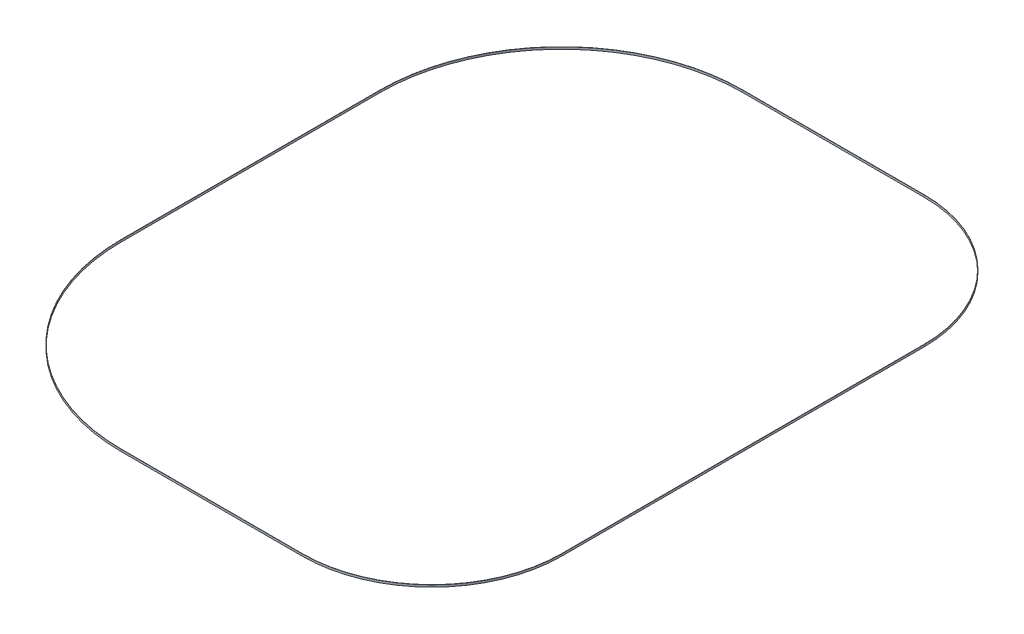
from build123d import *

# Parameters (mm, degrees)
LINEAR_AUSTRAGEN_D_NN1_DEPTH = 40


with BuildPart() as part:
    # Skizze1 → Linear-Austragen-D_nn1 (new, symmetric)
    with BuildSketch(Plane(origin=(0, 265, 0), x_dir=(1, 0, 0), z_dir=(0, 1, 0))):
        with BuildLine():
            Line((-4010, -3000), (-4010, 7000))
            ThreePointArc((-4010, 7000), (-1956.818536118, 11956.818536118), (3000, 14010))
            Line((3000, 14010), (10000, 14010))
            ThreePointArc((10000, 14010), (13542.604973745, 12542.604973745), (15010, 9000))
            Line((15010, 9000), (15010, -5000))
            ThreePointArc((15010, -5000), (13542.604973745, -8542.604973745), (10000, -10010))
            Line((10000, -10010), (3000, -10010))
            ThreePointArc((3000, -10010), (-1956.818536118, -7956.818536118), (-4010, -3000))
        make_face()
        with BuildLine():
            Line((-4000, -3000), (-4000, 7000))
            ThreePointArc((-4000, 7000), (-1949.747468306, 11949.747468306), (3000, 14000))
            Line((3000, 14000), (10000, 14000))
            ThreePointArc((10000, 14000), (13535.533905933, 12535.533905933), (15000, 9000))
            Line((15000, 9000), (15000, -5000))
            ThreePointArc((15000, -5000), (13535.533905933, -8535.533905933), (10000, -10000))
            Line((10000, -10000), (3000, -10000))
            ThreePointArc((3000, -10000), (-1949.747468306, -7949.747468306), (-4000, -3000))
        make_face(mode=Mode.SUBTRACT)
    extrude(amount=LINEAR_AUSTRAGEN_D_NN1_DEPTH, both=True)


solid = part.part
